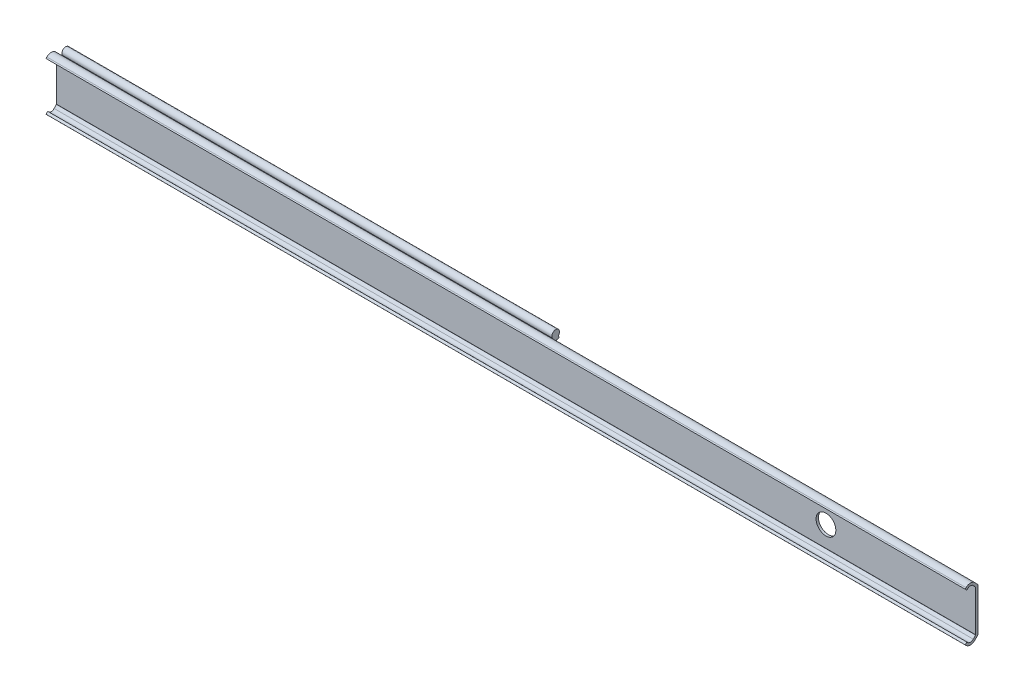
ISO-10303-21;
HEADER;
FILE_DESCRIPTION(('STEP AP214'),'2;1');
FILE_NAME('part.step','',(''),(''),'','','');
FILE_SCHEMA(('AUTOMOTIVE_DESIGN { 1 0 10303 214 1 1 1 1 }'));
ENDSEC;
DATA;
#1=APPLICATION_CONTEXT('core data for automotive mechanical design processes');
#2=APPLICATION_PROTOCOL_DEFINITION('international standard','automotive_design',2000,#1);
#3=PRODUCT_CONTEXT('',#1,'mechanical');
#4=PRODUCT('Part','Part','',(#3));
#5=PRODUCT_RELATED_PRODUCT_CATEGORY('part','',(#4));
#6=PRODUCT_DEFINITION_FORMATION('','',#4);
#7=PRODUCT_DEFINITION_CONTEXT('part definition',#1,'design');
#8=PRODUCT_DEFINITION('design','',#6,#7);
#9=PRODUCT_DEFINITION_SHAPE('','',#8);
#10=(LENGTH_UNIT() NAMED_UNIT(*) SI_UNIT(.MILLI.,.METRE.));
#11=(NAMED_UNIT(*) PLANE_ANGLE_UNIT() SI_UNIT($,.RADIAN.));
#12=(NAMED_UNIT(*) SI_UNIT($,.STERADIAN.) SOLID_ANGLE_UNIT());
#13=UNCERTAINTY_MEASURE_WITH_UNIT(LENGTH_MEASURE(1.E-05),#10,'distance_accuracy_value','');
#14=(GEOMETRIC_REPRESENTATION_CONTEXT(3) GLOBAL_UNCERTAINTY_ASSIGNED_CONTEXT((#13)) GLOBAL_UNIT_ASSIGNED_CONTEXT((#10,
#11,#12)) REPRESENTATION_CONTEXT('',''));
#15=CARTESIAN_POINT('',(0.,0.,0.));
#16=DIRECTION('',(0.,0.,1.));
#17=DIRECTION('',(1.,0.,0.));
#18=AXIS2_PLACEMENT_3D('',#15,#16,#17);
#19=CARTESIAN_POINT('',(-4.,-13.561018,0.));
#20=DIRECTION('',(0.,0.,-1.));
#21=DIRECTION('',(1.,0.,0.));
#22=AXIS2_PLACEMENT_3D('',#19,#20,#21);
#23=PLANE('',#22);
#24=CARTESIAN_POINT('',(506.987020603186,0.,0.));
#25=DIRECTION('',(0.,0.,1.));
#26=DIRECTION('',(1.,0.,0.));
#27=AXIS2_PLACEMENT_3D('',#24,#25,#26);
#28=CIRCLE('',#27,6.5);
#29=CARTESIAN_POINT('',(513.487020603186,0.,0.));
#30=VERTEX_POINT('',#29);
#31=EDGE_CURVE('E364',#30,#30,#28,.F.);
#32=ORIENTED_EDGE('',*,*,#31,.F.);
#33=EDGE_LOOP('',(#32));
#34=FACE_BOUND('',#33,.T.);
#35=DIRECTION('',(0.,-1.,0.));
#36=VECTOR('',#35,1.);
#37=CARTESIAN_POINT('',(0.,13.561018,0.));
#38=LINE('',#37,#36);
#39=CARTESIAN_POINT('',(0.,-10.7622239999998,0.));
#40=VERTEX_POINT('',#39);
#41=CARTESIAN_POINT('',(0.,-13.561018,0.));
#42=VERTEX_POINT('',#41);
#43=EDGE_CURVE('E325',#40,#42,#38,.T.);
#44=ORIENTED_EDGE('',*,*,#43,.F.);
#45=DIRECTION('',(1.,0.,0.));
#46=VECTOR('',#45,1.);
#47=CARTESIAN_POINT('',(0.,-10.7622239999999,0.));
#48=LINE('',#47,#46);
#49=CARTESIAN_POINT('',(322.8,-10.7622239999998,0.));
#50=VERTEX_POINT('',#49);
#51=EDGE_CURVE('E9',#40,#50,#48,.T.);
#52=ORIENTED_EDGE('',*,*,#51,.T.);
#53=DIRECTION('',(0.,-1.,0.));
#54=VECTOR('',#53,1.);
#55=CARTESIAN_POINT('',(322.8,10.7622239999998,0.));
#56=LINE('',#55,#54);
#57=CARTESIAN_POINT('',(322.8,10.7622239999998,0.));
#58=VERTEX_POINT('',#57);
#59=EDGE_CURVE('E300',#58,#50,#56,.T.);
#60=ORIENTED_EDGE('',*,*,#59,.F.);
#61=DIRECTION('',(1.,0.,0.));
#62=VECTOR('',#61,1.);
#63=CARTESIAN_POINT('',(0.,10.7622239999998,0.));
#64=LINE('',#63,#62);
#65=CARTESIAN_POINT('',(0.,10.7622239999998,0.));
#66=VERTEX_POINT('',#65);
#67=EDGE_CURVE('E23',#66,#58,#64,.T.);
#68=ORIENTED_EDGE('',*,*,#67,.F.);
#69=CARTESIAN_POINT('',(0.,13.561018,0.));
#70=VERTEX_POINT('',#69);
#71=EDGE_CURVE('E326',#70,#66,#38,.T.);
#72=ORIENTED_EDGE('',*,*,#71,.F.);
#73=DIRECTION('',(1.,0.,0.));
#74=VECTOR('',#73,1.);
#75=CARTESIAN_POINT('',(-4.,13.561018,0.));
#76=LINE('',#75,#74);
#77=CARTESIAN_POINT('',(605.6,13.561018,0.));
#78=VERTEX_POINT('',#77);
#79=EDGE_CURVE('E436',#70,#78,#76,.T.);
#80=ORIENTED_EDGE('',*,*,#79,.T.);
#81=DIRECTION('',(0.,1.,0.));
#82=VECTOR('',#81,1.);
#83=CARTESIAN_POINT('',(605.6,-13.561018,0.));
#84=LINE('',#83,#82);
#85=CARTESIAN_POINT('',(605.6,-13.561018,0.));
#86=VERTEX_POINT('',#85);
#87=EDGE_CURVE('E422',#86,#78,#84,.T.);
#88=ORIENTED_EDGE('',*,*,#87,.F.);
#89=DIRECTION('',(1.,0.,0.));
#90=VECTOR('',#89,1.);
#91=CARTESIAN_POINT('',(-4.,-13.561018,0.));
#92=LINE('',#91,#90);
#93=EDGE_CURVE('E438',#42,#86,#92,.T.);
#94=ORIENTED_EDGE('',*,*,#93,.F.);
#95=EDGE_LOOP('',(#44,#52,#60,#68,#72,#80,#88,#94));
#96=FACE_BOUND('',#95,.T.);
#97=ADVANCED_FACE('F14',(#34,#96),#23,.T.);
#98=CARTESIAN_POINT('',(0.,-10.7622239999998,-1.66000000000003));
#99=DIRECTION('',(1.,0.,0.));
#100=DIRECTION('',(0.,0.,1.));
#101=AXIS2_PLACEMENT_3D('',#98,#99,#100);
#102=CYLINDRICAL_SURFACE('',#101,1.66);
#103=DIRECTION('',(1.,0.,0.));
#104=VECTOR('',#103,1.);
#105=CARTESIAN_POINT('',(0.,-12.2669175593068,-2.36106867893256));
#106=LINE('',#105,#104);
#107=CARTESIAN_POINT('',(0.,-12.2669175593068,-2.36106867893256));
#108=VERTEX_POINT('',#107);
#109=CARTESIAN_POINT('',(322.8,-12.2669175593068,-2.36106867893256));
#110=VERTEX_POINT('',#109);
#111=EDGE_CURVE('E237',#108,#110,#106,.T.);
#112=ORIENTED_EDGE('',*,*,#111,.T.);
#113=CARTESIAN_POINT('',(322.8,-10.7622239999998,-1.66000000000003));
#114=DIRECTION('',(1.,0.,0.));
#115=DIRECTION('',(0.,0.,-1.));
#116=AXIS2_PLACEMENT_3D('',#113,#114,#115);
#117=CIRCLE('',#116,1.66);
#118=EDGE_CURVE('E302',#50,#110,#117,.T.);
#119=ORIENTED_EDGE('',*,*,#118,.F.);
#120=ORIENTED_EDGE('',*,*,#51,.F.);
#121=CARTESIAN_POINT('',(0.,-10.7622239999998,-1.66000000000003));
#122=DIRECTION('',(1.,0.,0.));
#123=DIRECTION('',(0.,0.,-1.));
#124=AXIS2_PLACEMENT_3D('',#121,#122,#123);
#125=CIRCLE('',#124,1.66);
#126=EDGE_CURVE('E249',#40,#108,#125,.T.);
#127=ORIENTED_EDGE('',*,*,#126,.T.);
#128=EDGE_LOOP('',(#112,#119,#120,#127));
#129=FACE_BOUND('',#128,.T.);
#130=ADVANCED_FACE('F255',(#129),#102,.T.);
#131=CARTESIAN_POINT('',(0.,10.7622239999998,-1.66000000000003));
#132=DIRECTION('',(1.,0.,0.));
#133=DIRECTION('',(0.,0.,1.));
#134=AXIS2_PLACEMENT_3D('',#131,#132,#133);
#135=CYLINDRICAL_SURFACE('',#134,1.66);
#136=CARTESIAN_POINT('',(322.8,10.7622239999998,-1.66000000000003));
#137=DIRECTION('',(1.,0.,0.));
#138=DIRECTION('',(0.,0.,-1.));
#139=AXIS2_PLACEMENT_3D('',#136,#137,#138);
#140=CIRCLE('',#139,1.66000000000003);
#141=CARTESIAN_POINT('',(322.8,12.2669175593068,-2.36106867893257));
#142=VERTEX_POINT('',#141);
#143=EDGE_CURVE('E294',#142,#58,#140,.T.);
#144=ORIENTED_EDGE('',*,*,#143,.F.);
#145=DIRECTION('',(1.,0.,0.));
#146=VECTOR('',#145,1.);
#147=CARTESIAN_POINT('',(0.,12.2669175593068,-2.36106867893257));
#148=LINE('',#147,#146);
#149=CARTESIAN_POINT('',(0.,12.2669175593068,-2.36106867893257));
#150=VERTEX_POINT('',#149);
#151=EDGE_CURVE('E292',#150,#142,#148,.T.);
#152=ORIENTED_EDGE('',*,*,#151,.F.);
#153=CARTESIAN_POINT('',(0.,10.7622239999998,-1.66000000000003));
#154=DIRECTION('',(1.,0.,0.));
#155=DIRECTION('',(0.,0.,-1.));
#156=AXIS2_PLACEMENT_3D('',#153,#154,#155);
#157=CIRCLE('',#156,1.66000000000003);
#158=EDGE_CURVE('E245',#150,#66,#157,.T.);
#159=ORIENTED_EDGE('',*,*,#158,.T.);
#160=ORIENTED_EDGE('',*,*,#67,.T.);
#161=EDGE_LOOP('',(#144,#152,#159,#160));
#162=FACE_BOUND('',#161,.T.);
#163=ADVANCED_FACE('F533',(#162),#135,.T.);
#164=CARTESIAN_POINT('',(0.,11.8784795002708,-5.98462837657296));
#165=DIRECTION('',(0.,0.60181512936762,-0.798635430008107));
#166=DIRECTION('',(0.,0.798635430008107,0.60181512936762));
#167=AXIS2_PLACEMENT_3D('',#164,#165,#166);
#168=PLANE('',#167);
#169=DIRECTION('',(1.,0.,0.));
#170=VECTOR('',#169,1.);
#171=CARTESIAN_POINT('',(0.,11.6159967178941,-6.18242339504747));
#172=LINE('',#171,#170);
#173=CARTESIAN_POINT('',(0.,11.6159967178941,-6.18242339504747));
#174=VERTEX_POINT('',#173);
#175=CARTESIAN_POINT('',(322.8,11.6159967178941,-6.18242339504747));
#176=VERTEX_POINT('',#175);
#177=EDGE_CURVE('E295',#174,#176,#172,.T.);
#178=ORIENTED_EDGE('',*,*,#177,.T.);
#179=DIRECTION('',(0.,0.798635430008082,0.601815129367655));
#180=VECTOR('',#179,1.);
#181=CARTESIAN_POINT('',(322.8,11.0618539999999,-6.60000000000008));
#182=LINE('',#181,#180);
#183=CARTESIAN_POINT('',(322.8,11.0618539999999,-6.60000000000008));
#184=VERTEX_POINT('',#183);
#185=EDGE_CURVE('E320',#184,#176,#182,.T.);
#186=ORIENTED_EDGE('',*,*,#185,.F.);
#187=DIRECTION('',(1.,0.,0.));
#188=VECTOR('',#187,1.);
#189=CARTESIAN_POINT('',(0.,11.0618539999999,-6.60000000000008));
#190=LINE('',#189,#188);
#191=CARTESIAN_POINT('',(0.,11.0618539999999,-6.60000000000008));
#192=VERTEX_POINT('',#191);
#193=EDGE_CURVE('E371',#192,#184,#190,.T.);
#194=ORIENTED_EDGE('',*,*,#193,.F.);
#195=DIRECTION('',(0.,0.798635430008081,0.601815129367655));
#196=VECTOR('',#195,1.);
#197=CARTESIAN_POINT('',(0.,11.0618539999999,-6.60000000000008));
#198=LINE('',#197,#196);
#199=EDGE_CURVE('E283',#192,#174,#198,.T.);
#200=ORIENTED_EDGE('',*,*,#199,.T.);
#201=EDGE_LOOP('',(#178,#186,#194,#200));
#202=FACE_BOUND('',#201,.T.);
#203=ADVANCED_FACE('F527',(#202),#168,.T.);
#204=CARTESIAN_POINT('',(0.,11.0618539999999,-6.60000000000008));
#205=DIRECTION('',(0.,0.,-1.));
#206=DIRECTION('',(1.,0.,0.));
#207=AXIS2_PLACEMENT_3D('',#204,#205,#206);
#208=PLANE('',#207);
#209=ORIENTED_EDGE('',*,*,#193,.T.);
#210=DIRECTION('',(0.,1.,-1.14893332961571E-13));
#211=VECTOR('',#210,1.);
#212=CARTESIAN_POINT('',(322.8,10.4239399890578,-6.6));
#213=LINE('',#212,#211);
#214=CARTESIAN_POINT('',(322.8,10.4239399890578,-6.6));
#215=VERTEX_POINT('',#214);
#216=EDGE_CURVE('E318',#215,#184,#213,.T.);
#217=ORIENTED_EDGE('',*,*,#216,.F.);
#218=DIRECTION('',(1.,0.,0.));
#219=VECTOR('',#218,1.);
#220=CARTESIAN_POINT('',(0.,10.4239399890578,-6.6));
#221=LINE('',#220,#219);
#222=CARTESIAN_POINT('',(0.,10.4239399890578,-6.6));
#223=VERTEX_POINT('',#222);
#224=EDGE_CURVE('E475',#223,#215,#221,.T.);
#225=ORIENTED_EDGE('',*,*,#224,.F.);
#226=DIRECTION('',(0.,1.,-1.07415068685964E-13));
#227=VECTOR('',#226,1.);
#228=CARTESIAN_POINT('',(0.,10.4239399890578,-6.6));
#229=LINE('',#228,#227);
#230=EDGE_CURVE('E280',#223,#192,#229,.T.);
#231=ORIENTED_EDGE('',*,*,#230,.T.);
#232=EDGE_LOOP('',(#209,#217,#225,#231));
#233=FACE_BOUND('',#232,.T.);
#234=ADVANCED_FACE('F522',(#233),#208,.T.);
#235=CARTESIAN_POINT('',(0.,13.915,-4.44999999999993));
#236=DIRECTION('',(1.,0.,0.));
#237=DIRECTION('',(0.,0.,1.));
#238=AXIS2_PLACEMENT_3D('',#235,#236,#237);
#239=CYLINDRICAL_SURFACE('',#238,4.1);
#240=ORIENTED_EDGE('',*,*,#224,.T.);
#241=CARTESIAN_POINT('',(322.8,13.915,-4.44999999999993));
#242=DIRECTION('',(1.,0.,0.));
#243=DIRECTION('',(0.,0.,-1.));
#244=AXIS2_PLACEMENT_3D('',#241,#242,#243);
#245=CIRCLE('',#244,4.1);
#246=CARTESIAN_POINT('',(322.8,10.844402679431,-1.73312089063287));
#247=VERTEX_POINT('',#246);
#248=EDGE_CURVE('E316',#247,#215,#245,.T.);
#249=ORIENTED_EDGE('',*,*,#248,.F.);
#250=DIRECTION('',(1.,0.,0.));
#251=VECTOR('',#250,1.);
#252=CARTESIAN_POINT('',(0.,10.8444026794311,-1.7331208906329));
#253=LINE('',#252,#251);
#254=CARTESIAN_POINT('',(0.,10.8444026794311,-1.73312089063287));
#255=VERTEX_POINT('',#254);
#256=EDGE_CURVE('E478',#255,#247,#253,.T.);
#257=ORIENTED_EDGE('',*,*,#256,.F.);
#258=CARTESIAN_POINT('',(0.,13.915,-4.44999999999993));
#259=DIRECTION('',(1.,0.,0.));
#260=DIRECTION('',(0.,0.,-1.));
#261=AXIS2_PLACEMENT_3D('',#258,#259,#260);
#262=CIRCLE('',#261,4.1);
#263=EDGE_CURVE('E277',#255,#223,#262,.T.);
#264=ORIENTED_EDGE('',*,*,#263,.T.);
#265=EDGE_LOOP('',(#240,#249,#257,#264));
#266=FACE_BOUND('',#265,.T.);
#267=ADVANCED_FACE('F520',(#266),#239,.T.);
#268=CARTESIAN_POINT('',(0.,10.7622239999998,-1.66000000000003));
#269=DIRECTION('',(1.,0.,0.));
#270=DIRECTION('',(0.,0.,1.));
#271=AXIS2_PLACEMENT_3D('',#268,#269,#270);
#272=CYLINDRICAL_SURFACE('',#271,0.110000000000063);
#273=ORIENTED_EDGE('',*,*,#256,.T.);
#274=CARTESIAN_POINT('',(322.8,10.7622239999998,-1.66000000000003));
#275=DIRECTION('',(-1.,0.,0.));
#276=DIRECTION('',(0.,0.,-1.));
#277=AXIS2_PLACEMENT_3D('',#274,#275,#276);
#278=CIRCLE('',#277,0.110000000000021);
#279=CARTESIAN_POINT('',(322.8,10.7622239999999,-1.55000000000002));
#280=VERTEX_POINT('',#279);
#281=EDGE_CURVE('E314',#280,#247,#278,.T.);
#282=ORIENTED_EDGE('',*,*,#281,.F.);
#283=DIRECTION('',(1.,0.,0.));
#284=VECTOR('',#283,1.);
#285=CARTESIAN_POINT('',(0.,10.7622239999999,-1.55000000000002));
#286=LINE('',#285,#284);
#287=CARTESIAN_POINT('',(0.,10.7622239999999,-1.55));
#288=VERTEX_POINT('',#287);
#289=EDGE_CURVE('E481',#288,#280,#286,.T.);
#290=ORIENTED_EDGE('',*,*,#289,.F.);
#291=CARTESIAN_POINT('',(0.,10.7622239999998,-1.66000000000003));
#292=DIRECTION('',(-1.,0.,0.));
#293=DIRECTION('',(0.,0.,-1.));
#294=AXIS2_PLACEMENT_3D('',#291,#292,#293);
#295=CIRCLE('',#294,0.110000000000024);
#296=EDGE_CURVE('E274',#288,#255,#295,.T.);
#297=ORIENTED_EDGE('',*,*,#296,.T.);
#298=EDGE_LOOP('',(#273,#282,#290,#297));
#299=FACE_BOUND('',#298,.T.);
#300=ADVANCED_FACE('F515',(#299),#272,.F.);
#301=CARTESIAN_POINT('',(0.,-10.7622239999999,-1.55000000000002));
#302=DIRECTION('',(0.,0.,-1.));
#303=DIRECTION('',(1.,0.,0.));
#304=AXIS2_PLACEMENT_3D('',#301,#302,#303);
#305=PLANE('',#304);
#306=ORIENTED_EDGE('',*,*,#289,.T.);
#307=DIRECTION('',(0.,1.,0.));
#308=VECTOR('',#307,1.);
#309=CARTESIAN_POINT('',(322.8,-10.7622239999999,-1.54999999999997));
#310=LINE('',#309,#308);
#311=CARTESIAN_POINT('',(322.8,-10.7622239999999,-1.54999999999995));
#312=VERTEX_POINT('',#311);
#313=EDGE_CURVE('E312',#312,#280,#310,.T.);
#314=ORIENTED_EDGE('',*,*,#313,.F.);
#315=DIRECTION('',(1.,0.,0.));
#316=VECTOR('',#315,1.);
#317=CARTESIAN_POINT('',(0.,-10.7622239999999,-1.55000000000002));
#318=LINE('',#317,#316);
#319=CARTESIAN_POINT('',(0.,-10.7622239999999,-1.54999999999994));
#320=VERTEX_POINT('',#319);
#321=EDGE_CURVE('E484',#320,#312,#318,.T.);
#322=ORIENTED_EDGE('',*,*,#321,.F.);
#323=DIRECTION('',(0.,1.,0.));
#324=VECTOR('',#323,1.);
#325=CARTESIAN_POINT('',(0.,-10.7622239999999,-1.54999999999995));
#326=LINE('',#325,#324);
#327=EDGE_CURVE('E271',#320,#288,#326,.T.);
#328=ORIENTED_EDGE('',*,*,#327,.T.);
#329=EDGE_LOOP('',(#306,#314,#322,#328));
#330=FACE_BOUND('',#329,.T.);
#331=ADVANCED_FACE('F510',(#330),#305,.T.);
#332=CARTESIAN_POINT('',(0.,-10.7622239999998,-1.66000000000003));
#333=DIRECTION('',(1.,0.,0.));
#334=DIRECTION('',(0.,0.,1.));
#335=AXIS2_PLACEMENT_3D('',#332,#333,#334);
#336=CYLINDRICAL_SURFACE('',#335,0.110000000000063);
#337=ORIENTED_EDGE('',*,*,#321,.T.);
#338=CARTESIAN_POINT('',(322.8,-10.7622239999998,-1.66000000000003));
#339=DIRECTION('',(-1.,0.,0.));
#340=DIRECTION('',(0.,0.,-1.));
#341=AXIS2_PLACEMENT_3D('',#338,#339,#340);
#342=CIRCLE('',#341,0.110000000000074);
#343=CARTESIAN_POINT('',(322.8,-10.8444026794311,-1.73312089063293));
#344=VERTEX_POINT('',#343);
#345=EDGE_CURVE('E310',#344,#312,#342,.T.);
#346=ORIENTED_EDGE('',*,*,#345,.F.);
#347=DIRECTION('',(1.,0.,0.));
#348=VECTOR('',#347,1.);
#349=CARTESIAN_POINT('',(0.,-10.8444026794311,-1.7331208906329));
#350=LINE('',#349,#348);
#351=CARTESIAN_POINT('',(0.,-10.8444026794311,-1.73312089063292));
#352=VERTEX_POINT('',#351);
#353=EDGE_CURVE('E487',#352,#344,#350,.T.);
#354=ORIENTED_EDGE('',*,*,#353,.F.);
#355=CARTESIAN_POINT('',(0.,-10.7622239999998,-1.66000000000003));
#356=DIRECTION('',(-1.,0.,0.));
#357=DIRECTION('',(0.,0.,-1.));
#358=AXIS2_PLACEMENT_3D('',#355,#356,#357);
#359=CIRCLE('',#358,0.110000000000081);
#360=EDGE_CURVE('E268',#352,#320,#359,.T.);
#361=ORIENTED_EDGE('',*,*,#360,.T.);
#362=EDGE_LOOP('',(#337,#346,#354,#361));
#363=FACE_BOUND('',#362,.T.);
#364=ADVANCED_FACE('F508',(#363),#336,.F.);
#365=CARTESIAN_POINT('',(0.,-13.915,-4.44999999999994));
#366=DIRECTION('',(1.,0.,0.));
#367=DIRECTION('',(0.,0.,1.));
#368=AXIS2_PLACEMENT_3D('',#365,#366,#367);
#369=CYLINDRICAL_SURFACE('',#368,4.1);
#370=ORIENTED_EDGE('',*,*,#353,.T.);
#371=CARTESIAN_POINT('',(322.8,-13.915,-4.44999999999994));
#372=DIRECTION('',(1.,0.,0.));
#373=DIRECTION('',(0.,0.,-1.));
#374=AXIS2_PLACEMENT_3D('',#371,#372,#373);
#375=CIRCLE('',#374,4.09999999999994);
#376=CARTESIAN_POINT('',(322.8,-10.4239399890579,-6.6));
#377=VERTEX_POINT('',#376);
#378=EDGE_CURVE('E308',#377,#344,#375,.T.);
#379=ORIENTED_EDGE('',*,*,#378,.F.);
#380=DIRECTION('',(1.,0.,0.));
#381=VECTOR('',#380,1.);
#382=CARTESIAN_POINT('',(0.,-10.4239399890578,-6.60000000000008));
#383=LINE('',#382,#381);
#384=CARTESIAN_POINT('',(0.,-10.4239399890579,-6.6));
#385=VERTEX_POINT('',#384);
#386=EDGE_CURVE('E489',#385,#377,#383,.T.);
#387=ORIENTED_EDGE('',*,*,#386,.F.);
#388=CARTESIAN_POINT('',(0.,-13.915,-4.44999999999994));
#389=DIRECTION('',(1.,0.,0.));
#390=DIRECTION('',(0.,0.,-1.));
#391=AXIS2_PLACEMENT_3D('',#388,#389,#390);
#392=CIRCLE('',#391,4.09999999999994);
#393=EDGE_CURVE('E265',#385,#352,#392,.T.);
#394=ORIENTED_EDGE('',*,*,#393,.T.);
#395=EDGE_LOOP('',(#370,#379,#387,#394));
#396=FACE_BOUND('',#395,.T.);
#397=ADVANCED_FACE('F501',(#396),#369,.T.);
#398=CARTESIAN_POINT('',(0.,-11.0618539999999,-6.60000000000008));
#399=DIRECTION('',(0.,0.,-1.));
#400=DIRECTION('',(1.,0.,0.));
#401=AXIS2_PLACEMENT_3D('',#398,#399,#400);
#402=PLANE('',#401);
#403=ORIENTED_EDGE('',*,*,#386,.T.);
#404=DIRECTION('',(0.,1.,0.));
#405=VECTOR('',#404,1.);
#406=CARTESIAN_POINT('',(322.8,-11.0618539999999,-6.60000000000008));
#407=LINE('',#406,#405);
#408=CARTESIAN_POINT('',(322.8,-11.0618539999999,-6.60000000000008));
#409=VERTEX_POINT('',#408);
#410=EDGE_CURVE('E306',#409,#377,#407,.T.);
#411=ORIENTED_EDGE('',*,*,#410,.F.);
#412=DIRECTION('',(1.,0.,0.));
#413=VECTOR('',#412,1.);
#414=CARTESIAN_POINT('',(0.,-11.0618539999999,-6.60000000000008));
#415=LINE('',#414,#413);
#416=CARTESIAN_POINT('',(0.,-11.0618539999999,-6.60000000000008));
#417=VERTEX_POINT('',#416);
#418=EDGE_CURVE('E18',#417,#409,#415,.T.);
#419=ORIENTED_EDGE('',*,*,#418,.F.);
#420=DIRECTION('',(0.,1.,0.));
#421=VECTOR('',#420,1.);
#422=CARTESIAN_POINT('',(0.,-11.0618539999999,-6.60000000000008));
#423=LINE('',#422,#421);
#424=EDGE_CURVE('E262',#417,#385,#423,.T.);
#425=ORIENTED_EDGE('',*,*,#424,.T.);
#426=EDGE_LOOP('',(#403,#411,#419,#425));
#427=FACE_BOUND('',#426,.T.);
#428=ADVANCED_FACE('F496',(#427),#402,.T.);
#429=CARTESIAN_POINT('',(0.,-11.8784795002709,-5.98462837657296));
#430=DIRECTION('',(0.,-0.60181512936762,-0.798635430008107));
#431=DIRECTION('',(0.,0.798635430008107,-0.60181512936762));
#432=AXIS2_PLACEMENT_3D('',#429,#430,#431);
#433=PLANE('',#432);
#434=DIRECTION('',(0.,0.79863543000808,-0.601815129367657));
#435=VECTOR('',#434,1.);
#436=CARTESIAN_POINT('',(322.8,-11.8784795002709,-5.98462837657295));
#437=LINE('',#436,#435);
#438=CARTESIAN_POINT('',(322.8,-11.6159967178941,-6.18242339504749));
#439=VERTEX_POINT('',#438);
#440=EDGE_CURVE('E304',#439,#409,#437,.T.);
#441=ORIENTED_EDGE('',*,*,#440,.F.);
#442=DIRECTION('',(1.,0.,0.));
#443=VECTOR('',#442,1.);
#444=CARTESIAN_POINT('',(0.,-11.6159967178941,-6.18242339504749));
#445=LINE('',#444,#443);
#446=CARTESIAN_POINT('',(0.,-11.6159967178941,-6.18242339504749));
#447=VERTEX_POINT('',#446);
#448=EDGE_CURVE('E244',#447,#439,#445,.T.);
#449=ORIENTED_EDGE('',*,*,#448,.F.);
#450=DIRECTION('',(0.,0.79863543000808,-0.601815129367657));
#451=VECTOR('',#450,1.);
#452=CARTESIAN_POINT('',(0.,-11.6159967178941,-6.18242339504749));
#453=LINE('',#452,#451);
#454=EDGE_CURVE('E253',#447,#417,#453,.T.);
#455=ORIENTED_EDGE('',*,*,#454,.T.);
#456=ORIENTED_EDGE('',*,*,#418,.T.);
#457=EDGE_LOOP('',(#441,#449,#455,#456));
#458=FACE_BOUND('',#457,.T.);
#459=ADVANCED_FACE('F16',(#458),#433,.T.);
#460=CARTESIAN_POINT('',(-4.,13.575,5.));
#461=DIRECTION('',(1.,0.,0.));
#462=DIRECTION('',(0.,0.,1.));
#463=AXIS2_PLACEMENT_3D('',#460,#461,#462);
#464=CYLINDRICAL_SURFACE('',#463,4.1);
#465=DIRECTION('',(1.,0.,0.));
#466=VECTOR('',#465,1.);
#467=CARTESIAN_POINT('',(-4.,16.4741282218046,2.10085261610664));
#468=LINE('',#467,#466);
#469=CARTESIAN_POINT('',(0.,16.4741282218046,2.10085261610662));
#470=VERTEX_POINT('',#469);
#471=CARTESIAN_POINT('',(605.6,16.4741282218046,2.10085261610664));
#472=VERTEX_POINT('',#471);
#473=EDGE_CURVE('E432',#470,#472,#468,.T.);
#474=ORIENTED_EDGE('',*,*,#473,.F.);
#475=CARTESIAN_POINT('',(0.,13.575,5.));
#476=DIRECTION('',(-1.,0.,0.));
#477=DIRECTION('',(0.,0.,1.));
#478=AXIS2_PLACEMENT_3D('',#475,#476,#477);
#479=CIRCLE('',#478,4.1);
#480=CARTESIAN_POINT('',(0.,16.4741282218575,7.89914738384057));
#481=VERTEX_POINT('',#480);
#482=EDGE_CURVE('E360',#481,#470,#479,.T.);
#483=ORIENTED_EDGE('',*,*,#482,.F.);
#484=DIRECTION('',(1.,0.,0.));
#485=VECTOR('',#484,1.);
#486=CARTESIAN_POINT('',(-4.,16.4741282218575,7.89914738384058));
#487=LINE('',#486,#485);
#488=CARTESIAN_POINT('',(605.6,16.4741282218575,7.89914738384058));
#489=VERTEX_POINT('',#488);
#490=EDGE_CURVE('E431',#481,#489,#487,.T.);
#491=ORIENTED_EDGE('',*,*,#490,.T.);
#492=CARTESIAN_POINT('',(605.6,13.575,5.));
#493=DIRECTION('',(1.,0.,0.));
#494=DIRECTION('',(0.,0.,-1.));
#495=AXIS2_PLACEMENT_3D('',#492,#493,#494);
#496=CIRCLE('',#495,4.1);
#497=EDGE_CURVE('E370',#472,#489,#496,.T.);
#498=ORIENTED_EDGE('',*,*,#497,.F.);
#499=EDGE_LOOP('',(#474,#483,#491,#498));
#500=FACE_BOUND('',#499,.T.);
#501=ADVANCED_FACE('F621',(#500),#464,.T.);
#502=CARTESIAN_POINT('',(-4.,14.8073560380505,0.501292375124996));
#503=DIRECTION('',(0.,0.692409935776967,-0.721504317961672));
#504=DIRECTION('',(0.,0.721504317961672,0.692409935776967));
#505=AXIS2_PLACEMENT_3D('',#502,#503,#504);
#506=PLANE('',#505);
#507=DIRECTION('',(1.,0.,0.));
#508=VECTOR('',#507,1.);
#509=CARTESIAN_POINT('',(-4.,14.8073560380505,0.501292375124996));
#510=LINE('',#509,#508);
#511=CARTESIAN_POINT('',(0.,14.8073560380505,0.501292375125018));
#512=VERTEX_POINT('',#511);
#513=CARTESIAN_POINT('',(605.6,14.8073560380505,0.501292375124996));
#514=VERTEX_POINT('',#513);
#515=EDGE_CURVE('E434',#512,#514,#510,.T.);
#516=ORIENTED_EDGE('',*,*,#515,.F.);
#517=DIRECTION('',(0.,-0.721504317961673,-0.692409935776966));
#518=VECTOR('',#517,1.);
#519=CARTESIAN_POINT('',(0.,16.4741282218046,2.10085261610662));
#520=LINE('',#519,#518);
#521=EDGE_CURVE('E362',#470,#512,#520,.T.);
#522=ORIENTED_EDGE('',*,*,#521,.F.);
#523=ORIENTED_EDGE('',*,*,#473,.T.);
#524=DIRECTION('',(0.,0.721504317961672,0.692409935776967));
#525=VECTOR('',#524,1.);
#526=CARTESIAN_POINT('',(605.6,14.8073560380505,0.501292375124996));
#527=LINE('',#526,#525);
#528=EDGE_CURVE('E428',#514,#472,#527,.T.);
#529=ORIENTED_EDGE('',*,*,#528,.F.);
#530=EDGE_LOOP('',(#516,#522,#523,#529));
#531=FACE_BOUND('',#530,.T.);
#532=ADVANCED_FACE('F626',(#531),#506,.T.);
#533=CARTESIAN_POINT('',(-4.,13.5610179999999,1.79999999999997));
#534=DIRECTION('',(1.,0.,0.));
#535=DIRECTION('',(0.,0.,1.));
#536=AXIS2_PLACEMENT_3D('',#533,#534,#535);
#537=CYLINDRICAL_SURFACE('',#536,1.8);
#538=ORIENTED_EDGE('',*,*,#79,.F.);
#539=CARTESIAN_POINT('',(0.,13.5610179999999,1.79999999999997));
#540=DIRECTION('',(-1.,0.,0.));
#541=DIRECTION('',(0.,0.,1.));
#542=AXIS2_PLACEMENT_3D('',#539,#540,#541);
#543=CIRCLE('',#542,1.80000000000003);
#544=EDGE_CURVE('E323',#512,#70,#543,.T.);
#545=ORIENTED_EDGE('',*,*,#544,.F.);
#546=ORIENTED_EDGE('',*,*,#515,.T.);
#547=CARTESIAN_POINT('',(605.6,13.5610179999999,1.79999999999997));
#548=DIRECTION('',(1.,0.,0.));
#549=DIRECTION('',(0.,0.,-1.));
#550=AXIS2_PLACEMENT_3D('',#547,#548,#549);
#551=CIRCLE('',#550,1.8);
#552=EDGE_CURVE('E425',#78,#514,#551,.T.);
#553=ORIENTED_EDGE('',*,*,#552,.F.);
#554=EDGE_LOOP('',(#538,#545,#546,#553));
#555=FACE_BOUND('',#554,.T.);
#556=ADVANCED_FACE('F629',(#555),#537,.T.);
#557=CARTESIAN_POINT('',(-4.,-13.561018,1.79999999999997));
#558=DIRECTION('',(1.,0.,0.));
#559=DIRECTION('',(0.,0.,1.));
#560=AXIS2_PLACEMENT_3D('',#557,#558,#559);
#561=CYLINDRICAL_SURFACE('',#560,1.8);
#562=DIRECTION('',(1.,0.,0.));
#563=VECTOR('',#562,1.);
#564=CARTESIAN_POINT('',(-4.,-14.8073560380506,0.501292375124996));
#565=LINE('',#564,#563);
#566=CARTESIAN_POINT('',(0.,-14.8073560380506,0.501292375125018));
#567=VERTEX_POINT('',#566);
#568=CARTESIAN_POINT('',(605.6,-14.8073560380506,0.501292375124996));
#569=VERTEX_POINT('',#568);
#570=EDGE_CURVE('E440',#567,#569,#565,.T.);
#571=ORIENTED_EDGE('',*,*,#570,.F.);
#572=CARTESIAN_POINT('',(0.,-13.561018,1.79999999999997));
#573=DIRECTION('',(-1.,0.,0.));
#574=DIRECTION('',(0.,0.,1.));
#575=AXIS2_PLACEMENT_3D('',#572,#573,#574);
#576=CIRCLE('',#575,1.8);
#577=EDGE_CURVE('E329',#42,#567,#576,.T.);
#578=ORIENTED_EDGE('',*,*,#577,.F.);
#579=ORIENTED_EDGE('',*,*,#93,.T.);
#580=CARTESIAN_POINT('',(605.6,-13.561018,1.79999999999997));
#581=DIRECTION('',(1.,0.,0.));
#582=DIRECTION('',(0.,0.,1.));
#583=AXIS2_PLACEMENT_3D('',#580,#581,#582);
#584=CIRCLE('',#583,1.8);
#585=EDGE_CURVE('E419',#569,#86,#584,.T.);
#586=ORIENTED_EDGE('',*,*,#585,.F.);
#587=EDGE_LOOP('',(#571,#578,#579,#586));
#588=FACE_BOUND('',#587,.T.);
#589=ADVANCED_FACE('F543',(#588),#561,.T.);
#590=CARTESIAN_POINT('',(-4.,-14.8073560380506,0.501292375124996));
#591=DIRECTION('',(0.,-0.692409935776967,-0.721504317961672));
#592=DIRECTION('',(0.,0.721504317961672,-0.692409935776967));
#593=AXIS2_PLACEMENT_3D('',#590,#591,#592);
#594=PLANE('',#593);
#595=DIRECTION('',(1.,0.,0.));
#596=VECTOR('',#595,1.);
#597=CARTESIAN_POINT('',(-4.,-16.4741282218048,2.10085261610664));
#598=LINE('',#597,#596);
#599=CARTESIAN_POINT('',(0.,-16.4741282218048,2.10085261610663));
#600=VERTEX_POINT('',#599);
#601=CARTESIAN_POINT('',(605.6,-16.4741282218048,2.10085261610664));
#602=VERTEX_POINT('',#601);
#603=EDGE_CURVE('E442',#600,#602,#598,.T.);
#604=ORIENTED_EDGE('',*,*,#603,.F.);
#605=DIRECTION('',(0.,-0.721504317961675,0.692409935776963));
#606=VECTOR('',#605,1.);
#607=CARTESIAN_POINT('',(0.,-14.8073560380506,0.501292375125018));
#608=LINE('',#607,#606);
#609=EDGE_CURVE('E331',#567,#600,#608,.T.);
#610=ORIENTED_EDGE('',*,*,#609,.F.);
#611=ORIENTED_EDGE('',*,*,#570,.T.);
#612=DIRECTION('',(0.,0.721504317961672,-0.692409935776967));
#613=VECTOR('',#612,1.);
#614=CARTESIAN_POINT('',(605.6,-14.8073560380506,0.501292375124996));
#615=LINE('',#614,#613);
#616=EDGE_CURVE('E416',#602,#569,#615,.T.);
#617=ORIENTED_EDGE('',*,*,#616,.F.);
#618=EDGE_LOOP('',(#604,#610,#611,#617));
#619=FACE_BOUND('',#618,.T.);
#620=ADVANCED_FACE('F548',(#619),#594,.T.);
#621=CARTESIAN_POINT('',(-4.,-13.5750000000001,5.));
#622=DIRECTION('',(1.,0.,0.));
#623=DIRECTION('',(0.,0.,1.));
#624=AXIS2_PLACEMENT_3D('',#621,#622,#623);
#625=CYLINDRICAL_SURFACE('',#624,4.1);
#626=DIRECTION('',(1.,0.,0.));
#627=VECTOR('',#626,1.);
#628=CARTESIAN_POINT('',(-4.,-16.4741282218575,7.89914738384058));
#629=LINE('',#628,#627);
#630=CARTESIAN_POINT('',(0.,-16.4741282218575,7.89914738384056));
#631=VERTEX_POINT('',#630);
#632=CARTESIAN_POINT('',(605.6,-16.4741282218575,7.89914738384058));
#633=VERTEX_POINT('',#632);
#634=EDGE_CURVE('E444',#631,#633,#629,.T.);
#635=ORIENTED_EDGE('',*,*,#634,.F.);
#636=CARTESIAN_POINT('',(0.,-13.5750000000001,5.));
#637=DIRECTION('',(-1.,0.,0.));
#638=DIRECTION('',(0.,0.,1.));
#639=AXIS2_PLACEMENT_3D('',#636,#637,#638);
#640=CIRCLE('',#639,4.09999999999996);
#641=EDGE_CURVE('E333',#600,#631,#640,.T.);
#642=ORIENTED_EDGE('',*,*,#641,.F.);
#643=ORIENTED_EDGE('',*,*,#603,.T.);
#644=CARTESIAN_POINT('',(605.6,-13.5750000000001,5.));
#645=DIRECTION('',(1.,0.,0.));
#646=DIRECTION('',(0.,0.,1.));
#647=AXIS2_PLACEMENT_3D('',#644,#645,#646);
#648=CIRCLE('',#647,4.1);
#649=EDGE_CURVE('E413',#633,#602,#648,.T.);
#650=ORIENTED_EDGE('',*,*,#649,.F.);
#651=EDGE_LOOP('',(#635,#642,#643,#650));
#652=FACE_BOUND('',#651,.T.);
#653=ADVANCED_FACE('F553',(#652),#625,.T.);
#654=CARTESIAN_POINT('',(-4.,-15.8897090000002,8.46));
#655=DIRECTION('',(0.,-0.692409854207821,0.721504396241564));
#656=DIRECTION('',(0.,-0.721504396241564,-0.692409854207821));
#657=AXIS2_PLACEMENT_3D('',#654,#655,#656);
#658=PLANE('',#657);
#659=DIRECTION('',(1.,0.,0.));
#660=VECTOR('',#659,1.);
#661=CARTESIAN_POINT('',(-4.,-15.8897090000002,8.46));
#662=LINE('',#661,#660);
#663=CARTESIAN_POINT('',(0.,-15.8897090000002,8.46));
#664=VERTEX_POINT('',#663);
#665=CARTESIAN_POINT('',(605.6,-15.8897090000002,8.46));
#666=VERTEX_POINT('',#665);
#667=EDGE_CURVE('E446',#664,#666,#662,.T.);
#668=ORIENTED_EDGE('',*,*,#667,.F.);
#669=DIRECTION('',(0.,0.721504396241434,0.692409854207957));
#670=VECTOR('',#669,1.);
#671=CARTESIAN_POINT('',(0.,-16.4741282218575,7.89914738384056));
#672=LINE('',#671,#670);
#673=EDGE_CURVE('E335',#631,#664,#672,.T.);
#674=ORIENTED_EDGE('',*,*,#673,.F.);
#675=ORIENTED_EDGE('',*,*,#634,.T.);
#676=DIRECTION('',(0.,-0.721504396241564,-0.692409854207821));
#677=VECTOR('',#676,1.);
#678=CARTESIAN_POINT('',(605.6,-15.8897090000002,8.46));
#679=LINE('',#678,#677);
#680=EDGE_CURVE('E410',#666,#633,#679,.T.);
#681=ORIENTED_EDGE('',*,*,#680,.F.);
#682=EDGE_LOOP('',(#668,#674,#675,#681));
#683=FACE_BOUND('',#682,.T.);
#684=ADVANCED_FACE('F558',(#683),#658,.T.);
#685=CARTESIAN_POINT('',(-4.,-14.7934620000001,7.36375199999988));
#686=DIRECTION('',(0.,0.707107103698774,0.707106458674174));
#687=DIRECTION('',(0.,-0.707106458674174,0.707107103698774));
#688=AXIS2_PLACEMENT_3D('',#685,#686,#687);
#689=PLANE('',#688);
#690=DIRECTION('',(1.,0.,0.));
#691=VECTOR('',#690,1.);
#692=CARTESIAN_POINT('',(-4.,-14.7934620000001,7.36375199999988));
#693=LINE('',#692,#691);
#694=CARTESIAN_POINT('',(0.,-14.7934620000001,7.36375199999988));
#695=VERTEX_POINT('',#694);
#696=CARTESIAN_POINT('',(605.6,-14.7934620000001,7.36375199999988));
#697=VERTEX_POINT('',#696);
#698=EDGE_CURVE('E448',#695,#697,#693,.T.);
#699=ORIENTED_EDGE('',*,*,#698,.F.);
#700=DIRECTION('',(0.,0.707106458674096,-0.707107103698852));
#701=VECTOR('',#700,1.);
#702=CARTESIAN_POINT('',(0.,-15.8897090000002,8.46));
#703=LINE('',#702,#701);
#704=EDGE_CURVE('E337',#664,#695,#703,.T.);
#705=ORIENTED_EDGE('',*,*,#704,.F.);
#706=ORIENTED_EDGE('',*,*,#667,.T.);
#707=DIRECTION('',(0.,-0.707106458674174,0.707107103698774));
#708=VECTOR('',#707,1.);
#709=CARTESIAN_POINT('',(605.6,-14.7934620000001,7.36375199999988));
#710=LINE('',#709,#708);
#711=EDGE_CURVE('E407',#697,#666,#710,.T.);
#712=ORIENTED_EDGE('',*,*,#711,.F.);
#713=EDGE_LOOP('',(#699,#705,#706,#712));
#714=FACE_BOUND('',#713,.T.);
#715=ADVANCED_FACE('F563',(#714),#689,.T.);
#716=CARTESIAN_POINT('',(-4.,-15.3880487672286,6.79314086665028));
#717=DIRECTION('',(0.,0.692410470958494,-0.721503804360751));
#718=DIRECTION('',(0.,0.721503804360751,0.692410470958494));
#719=AXIS2_PLACEMENT_3D('',#716,#717,#718);
#720=PLANE('',#719);
#721=DIRECTION('',(1.,0.,0.));
#722=VECTOR('',#721,1.);
#723=CARTESIAN_POINT('',(-4.,-15.3880487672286,6.79314086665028));
#724=LINE('',#723,#722);
#725=CARTESIAN_POINT('',(0.,-15.3880487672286,6.79314086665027));
#726=VERTEX_POINT('',#725);
#727=CARTESIAN_POINT('',(605.6,-15.3880487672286,6.79314086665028));
#728=VERTEX_POINT('',#727);
#729=EDGE_CURVE('E450',#726,#728,#724,.T.);
#730=ORIENTED_EDGE('',*,*,#729,.F.);
#731=DIRECTION('',(0.,-0.721503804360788,-0.692410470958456));
#732=VECTOR('',#731,1.);
#733=CARTESIAN_POINT('',(0.,-14.7934620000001,7.36375199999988));
#734=LINE('',#733,#732);
#735=EDGE_CURVE('E339',#695,#726,#734,.T.);
#736=ORIENTED_EDGE('',*,*,#735,.F.);
#737=ORIENTED_EDGE('',*,*,#698,.T.);
#738=DIRECTION('',(0.,0.721503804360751,0.692410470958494));
#739=VECTOR('',#738,1.);
#740=CARTESIAN_POINT('',(605.6,-15.3880487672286,6.79314086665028));
#741=LINE('',#740,#739);
#742=EDGE_CURVE('E404',#728,#697,#741,.T.);
#743=ORIENTED_EDGE('',*,*,#742,.F.);
#744=EDGE_LOOP('',(#730,#736,#737,#743));
#745=FACE_BOUND('',#744,.T.);
#746=ADVANCED_FACE('F568',(#745),#720,.T.);
#747=CARTESIAN_POINT('',(-4.,-13.5750000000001,5.));
#748=DIRECTION('',(1.,0.,0.));
#749=DIRECTION('',(0.,0.,1.));
#750=AXIS2_PLACEMENT_3D('',#747,#748,#749);
#751=CYLINDRICAL_SURFACE('',#750,2.55);
#752=DIRECTION('',(1.,0.,0.));
#753=VECTOR('',#752,1.);
#754=CARTESIAN_POINT('',(-4.,-15.292068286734,3.11474762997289));
#755=LINE('',#754,#753);
#756=CARTESIAN_POINT('',(0.,-15.292068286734,3.11474762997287));
#757=VERTEX_POINT('',#756);
#758=CARTESIAN_POINT('',(605.6,-15.292068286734,3.11474762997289));
#759=VERTEX_POINT('',#758);
#760=EDGE_CURVE('E452',#757,#759,#755,.T.);
#761=ORIENTED_EDGE('',*,*,#760,.F.);
#762=CARTESIAN_POINT('',(0.,-13.5750000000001,5.));
#763=DIRECTION('',(1.,0.,0.));
#764=DIRECTION('',(0.,0.,1.));
#765=AXIS2_PLACEMENT_3D('',#762,#763,#764);
#766=CIRCLE('',#765,2.55);
#767=EDGE_CURVE('E341',#726,#757,#766,.T.);
#768=ORIENTED_EDGE('',*,*,#767,.F.);
#769=ORIENTED_EDGE('',*,*,#729,.T.);
#770=CARTESIAN_POINT('',(605.6,-13.5750000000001,5.));
#771=DIRECTION('',(-1.,0.,0.));
#772=DIRECTION('',(0.,0.,-1.));
#773=AXIS2_PLACEMENT_3D('',#770,#771,#772);
#774=CIRCLE('',#773,2.55);
#775=EDGE_CURVE('E401',#759,#728,#774,.T.);
#776=ORIENTED_EDGE('',*,*,#775,.F.);
#777=EDGE_LOOP('',(#761,#768,#769,#776));
#778=FACE_BOUND('',#777,.T.);
#779=ADVANCED_FACE('F573',(#778),#751,.F.);
#780=CARTESIAN_POINT('',(-4.,-13.7341205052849,1.6196239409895));
#781=DIRECTION('',(0.,0.692409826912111,0.721504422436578));
#782=DIRECTION('',(0.,-0.721504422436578,0.692409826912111));
#783=AXIS2_PLACEMENT_3D('',#780,#781,#782);
#784=PLANE('',#783);
#785=DIRECTION('',(1.,0.,0.));
#786=VECTOR('',#785,1.);
#787=CARTESIAN_POINT('',(-4.,-13.734120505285,1.61962394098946));
#788=LINE('',#787,#786);
#789=CARTESIAN_POINT('',(0.,-13.734120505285,1.61962394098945));
#790=VERTEX_POINT('',#789);
#791=CARTESIAN_POINT('',(605.6,-13.734120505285,1.61962394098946));
#792=VERTEX_POINT('',#791);
#793=EDGE_CURVE('E454',#790,#792,#788,.T.);
#794=ORIENTED_EDGE('',*,*,#793,.F.);
#795=DIRECTION('',(0.,0.721504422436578,-0.692409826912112));
#796=VECTOR('',#795,1.);
#797=CARTESIAN_POINT('',(0.,-15.292068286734,3.11474762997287));
#798=LINE('',#797,#796);
#799=EDGE_CURVE('E343',#757,#790,#798,.T.);
#800=ORIENTED_EDGE('',*,*,#799,.F.);
#801=ORIENTED_EDGE('',*,*,#760,.T.);
#802=DIRECTION('',(0.,-0.721504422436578,0.692409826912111));
#803=VECTOR('',#802,1.);
#804=CARTESIAN_POINT('',(605.6,-13.7341205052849,1.6196239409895));
#805=LINE('',#804,#803);
#806=EDGE_CURVE('E398',#792,#759,#805,.T.);
#807=ORIENTED_EDGE('',*,*,#806,.F.);
#808=EDGE_LOOP('',(#794,#800,#801,#807));
#809=FACE_BOUND('',#808,.T.);
#810=ADVANCED_FACE('F578',(#809),#784,.T.);
#811=CARTESIAN_POINT('',(-4.,-13.561018,1.79999999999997));
#812=DIRECTION('',(1.,0.,0.));
#813=DIRECTION('',(0.,0.,1.));
#814=AXIS2_PLACEMENT_3D('',#811,#812,#813);
#815=CYLINDRICAL_SURFACE('',#814,0.250000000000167);
#816=DIRECTION('',(1.,0.,0.));
#817=VECTOR('',#816,1.);
#818=CARTESIAN_POINT('',(-4.,-13.561018,1.54999999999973));
#819=LINE('',#818,#817);
#820=CARTESIAN_POINT('',(0.,-13.561018,1.54999999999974));
#821=VERTEX_POINT('',#820);
#822=CARTESIAN_POINT('',(605.6,-13.561018,1.54999999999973));
#823=VERTEX_POINT('',#822);
#824=EDGE_CURVE('E456',#821,#823,#819,.T.);
#825=ORIENTED_EDGE('',*,*,#824,.F.);
#826=CARTESIAN_POINT('',(0.,-13.561018,1.79999999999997));
#827=DIRECTION('',(1.,0.,0.));
#828=DIRECTION('',(0.,0.,1.));
#829=AXIS2_PLACEMENT_3D('',#826,#827,#828);
#830=CIRCLE('',#829,0.250000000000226);
#831=EDGE_CURVE('E345',#790,#821,#830,.T.);
#832=ORIENTED_EDGE('',*,*,#831,.F.);
#833=ORIENTED_EDGE('',*,*,#793,.T.);
#834=CARTESIAN_POINT('',(605.6,-13.561018,1.79999999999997));
#835=DIRECTION('',(-1.,0.,0.));
#836=DIRECTION('',(0.,0.,-1.));
#837=AXIS2_PLACEMENT_3D('',#834,#835,#836);
#838=CIRCLE('',#837,0.250000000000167);
#839=EDGE_CURVE('E395',#823,#792,#838,.T.);
#840=ORIENTED_EDGE('',*,*,#839,.F.);
#841=EDGE_LOOP('',(#825,#832,#833,#840));
#842=FACE_BOUND('',#841,.T.);
#843=ADVANCED_FACE('F583',(#842),#815,.F.);
#844=CARTESIAN_POINT('',(-4.,13.561018,1.54999999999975));
#845=DIRECTION('',(0.,0.,1.));
#846=DIRECTION('',(-1.,0.,0.));
#847=AXIS2_PLACEMENT_3D('',#844,#845,#846);
#848=PLANE('',#847);
#849=CARTESIAN_POINT('',(506.987020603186,0.,1.54999999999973));
#850=DIRECTION('',(0.,0.,1.));
#851=DIRECTION('',(-1.,0.,0.));
#852=AXIS2_PLACEMENT_3D('',#849,#850,#851);
#853=CIRCLE('',#852,6.5);
#854=CARTESIAN_POINT('',(500.487020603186,0.,1.54999999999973));
#855=VERTEX_POINT('',#854);
#856=EDGE_CURVE('E367',#855,#855,#853,.T.);
#857=ORIENTED_EDGE('',*,*,#856,.F.);
#858=EDGE_LOOP('',(#857));
#859=FACE_BOUND('',#858,.T.);
#860=DIRECTION('',(1.,0.,0.));
#861=VECTOR('',#860,1.);
#862=CARTESIAN_POINT('',(-4.,13.561018,1.54999999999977));
#863=LINE('',#862,#861);
#864=CARTESIAN_POINT('',(0.,13.561018,1.54999999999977));
#865=VERTEX_POINT('',#864);
#866=CARTESIAN_POINT('',(605.6,13.561018,1.54999999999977));
#867=VERTEX_POINT('',#866);
#868=EDGE_CURVE('E458',#865,#867,#863,.T.);
#869=ORIENTED_EDGE('',*,*,#868,.F.);
#870=DIRECTION('',(0.,1.,0.));
#871=VECTOR('',#870,1.);
#872=CARTESIAN_POINT('',(0.,-13.561018,1.54999999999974));
#873=LINE('',#872,#871);
#874=EDGE_CURVE('E347',#821,#865,#873,.T.);
#875=ORIENTED_EDGE('',*,*,#874,.F.);
#876=ORIENTED_EDGE('',*,*,#824,.T.);
#877=DIRECTION('',(0.,-1.,0.));
#878=VECTOR('',#877,1.);
#879=CARTESIAN_POINT('',(605.6,13.561018,1.54999999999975));
#880=LINE('',#879,#878);
#881=EDGE_CURVE('E392',#867,#823,#880,.T.);
#882=ORIENTED_EDGE('',*,*,#881,.F.);
#883=EDGE_LOOP('',(#869,#875,#876,#882));
#884=FACE_BOUND('',#883,.T.);
#885=ADVANCED_FACE('F588',(#859,#884),#848,.T.);
#886=CARTESIAN_POINT('',(-4.,13.5610179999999,1.79999999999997));
#887=DIRECTION('',(1.,0.,0.));
#888=DIRECTION('',(0.,0.,1.));
#889=AXIS2_PLACEMENT_3D('',#886,#887,#888);
#890=CYLINDRICAL_SURFACE('',#889,0.250000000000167);
#891=DIRECTION('',(1.,0.,0.));
#892=VECTOR('',#891,1.);
#893=CARTESIAN_POINT('',(-4.,13.734120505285,1.6196239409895));
#894=LINE('',#893,#892);
#895=CARTESIAN_POINT('',(0.,13.734120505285,1.6196239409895));
#896=VERTEX_POINT('',#895);
#897=CARTESIAN_POINT('',(605.6,13.734120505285,1.6196239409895));
#898=VERTEX_POINT('',#897);
#899=EDGE_CURVE('E460',#896,#898,#894,.T.);
#900=ORIENTED_EDGE('',*,*,#899,.F.);
#901=CARTESIAN_POINT('',(0.,13.5610179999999,1.79999999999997));
#902=DIRECTION('',(1.,0.,0.));
#903=DIRECTION('',(0.,0.,1.));
#904=AXIS2_PLACEMENT_3D('',#901,#902,#903);
#905=CIRCLE('',#904,0.250000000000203);
#906=EDGE_CURVE('E349',#865,#896,#905,.T.);
#907=ORIENTED_EDGE('',*,*,#906,.F.);
#908=ORIENTED_EDGE('',*,*,#868,.T.);
#909=CARTESIAN_POINT('',(605.6,13.5610179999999,1.79999999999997));
#910=DIRECTION('',(-1.,0.,0.));
#911=DIRECTION('',(0.,0.,1.));
#912=AXIS2_PLACEMENT_3D('',#909,#910,#911);
#913=CIRCLE('',#912,0.250000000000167);
#914=EDGE_CURVE('E389',#898,#867,#913,.T.);
#915=ORIENTED_EDGE('',*,*,#914,.F.);
#916=EDGE_LOOP('',(#900,#907,#908,#915));
#917=FACE_BOUND('',#916,.T.);
#918=ADVANCED_FACE('F593',(#917),#890,.F.);
#919=CARTESIAN_POINT('',(-4.,13.734120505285,1.6196239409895));
#920=DIRECTION('',(0.,-0.692409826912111,0.721504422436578));
#921=DIRECTION('',(0.,-0.721504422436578,-0.692409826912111));
#922=AXIS2_PLACEMENT_3D('',#919,#920,#921);
#923=PLANE('',#922);
#924=DIRECTION('',(1.,0.,0.));
#925=VECTOR('',#924,1.);
#926=CARTESIAN_POINT('',(-4.,15.2920682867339,3.11474762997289));
#927=LINE('',#926,#925);
#928=CARTESIAN_POINT('',(0.,15.2920682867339,3.11474762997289));
#929=VERTEX_POINT('',#928);
#930=CARTESIAN_POINT('',(605.6,15.2920682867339,3.11474762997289));
#931=VERTEX_POINT('',#930);
#932=EDGE_CURVE('E462',#929,#931,#927,.T.);
#933=ORIENTED_EDGE('',*,*,#932,.F.);
#934=DIRECTION('',(0.,0.721504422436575,0.692409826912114));
#935=VECTOR('',#934,1.);
#936=CARTESIAN_POINT('',(0.,13.734120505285,1.6196239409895));
#937=LINE('',#936,#935);
#938=EDGE_CURVE('E351',#896,#929,#937,.T.);
#939=ORIENTED_EDGE('',*,*,#938,.F.);
#940=ORIENTED_EDGE('',*,*,#899,.T.);
#941=DIRECTION('',(0.,-0.721504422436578,-0.692409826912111));
#942=VECTOR('',#941,1.);
#943=CARTESIAN_POINT('',(605.6,13.734120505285,1.6196239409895));
#944=LINE('',#943,#942);
#945=EDGE_CURVE('E386',#931,#898,#944,.T.);
#946=ORIENTED_EDGE('',*,*,#945,.F.);
#947=EDGE_LOOP('',(#933,#939,#940,#946));
#948=FACE_BOUND('',#947,.T.);
#949=ADVANCED_FACE('F598',(#948),#923,.T.);
#950=CARTESIAN_POINT('',(-4.,13.575,5.));
#951=DIRECTION('',(1.,0.,0.));
#952=DIRECTION('',(0.,0.,1.));
#953=AXIS2_PLACEMENT_3D('',#950,#951,#952);
#954=CYLINDRICAL_SURFACE('',#953,2.55);
#955=DIRECTION('',(1.,0.,0.));
#956=VECTOR('',#955,1.);
#957=CARTESIAN_POINT('',(-4.,15.3880487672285,6.79314086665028));
#958=LINE('',#957,#956);
#959=CARTESIAN_POINT('',(0.,15.3880487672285,6.79314086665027));
#960=VERTEX_POINT('',#959);
#961=CARTESIAN_POINT('',(605.6,15.3880487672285,6.79314086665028));
#962=VERTEX_POINT('',#961);
#963=EDGE_CURVE('E464',#960,#962,#958,.T.);
#964=ORIENTED_EDGE('',*,*,#963,.F.);
#965=CARTESIAN_POINT('',(0.,13.575,5.));
#966=DIRECTION('',(1.,0.,0.));
#967=DIRECTION('',(0.,0.,1.));
#968=AXIS2_PLACEMENT_3D('',#965,#966,#967);
#969=CIRCLE('',#968,2.55000000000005);
#970=EDGE_CURVE('E353',#929,#960,#969,.T.);
#971=ORIENTED_EDGE('',*,*,#970,.F.);
#972=ORIENTED_EDGE('',*,*,#932,.T.);
#973=CARTESIAN_POINT('',(605.6,13.575,5.));
#974=DIRECTION('',(-1.,0.,0.));
#975=DIRECTION('',(0.,0.,1.));
#976=AXIS2_PLACEMENT_3D('',#973,#974,#975);
#977=CIRCLE('',#976,2.55);
#978=EDGE_CURVE('E383',#962,#931,#977,.T.);
#979=ORIENTED_EDGE('',*,*,#978,.F.);
#980=EDGE_LOOP('',(#964,#971,#972,#979));
#981=FACE_BOUND('',#980,.T.);
#982=ADVANCED_FACE('F603',(#981),#954,.F.);
#983=CARTESIAN_POINT('',(-4.,15.3880487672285,6.79314086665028));
#984=DIRECTION('',(0.,-0.692410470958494,-0.721503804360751));
#985=DIRECTION('',(0.,0.721503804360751,-0.692410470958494));
#986=AXIS2_PLACEMENT_3D('',#983,#984,#985);
#987=PLANE('',#986);
#988=DIRECTION('',(1.,0.,0.));
#989=VECTOR('',#988,1.);
#990=CARTESIAN_POINT('',(-4.,14.793462,7.363752));
#991=LINE('',#990,#989);
#992=CARTESIAN_POINT('',(0.,14.793462,7.363752));
#993=VERTEX_POINT('',#992);
#994=CARTESIAN_POINT('',(605.6,14.793462,7.363752));
#995=VERTEX_POINT('',#994);
#996=EDGE_CURVE('E466',#993,#995,#991,.T.);
#997=ORIENTED_EDGE('',*,*,#996,.F.);
#998=DIRECTION('',(0.,-0.721503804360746,0.692410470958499));
#999=VECTOR('',#998,1.);
#1000=CARTESIAN_POINT('',(0.,15.3880487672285,6.79314086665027));
#1001=LINE('',#1000,#999);
#1002=EDGE_CURVE('E355',#960,#993,#1001,.T.);
#1003=ORIENTED_EDGE('',*,*,#1002,.F.);
#1004=ORIENTED_EDGE('',*,*,#963,.T.);
#1005=DIRECTION('',(0.,0.721503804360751,-0.692410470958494));
#1006=VECTOR('',#1005,1.);
#1007=CARTESIAN_POINT('',(605.6,15.3880487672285,6.79314086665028));
#1008=LINE('',#1007,#1006);
#1009=EDGE_CURVE('E380',#995,#962,#1008,.T.);
#1010=ORIENTED_EDGE('',*,*,#1009,.F.);
#1011=EDGE_LOOP('',(#997,#1003,#1004,#1010));
#1012=FACE_BOUND('',#1011,.T.);
#1013=ADVANCED_FACE('F608',(#1012),#987,.T.);
#1014=CARTESIAN_POINT('',(-4.,14.793462,7.363752));
#1015=DIRECTION('',(0.,-0.707107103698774,0.707106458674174));
#1016=DIRECTION('',(0.,-0.707106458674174,-0.707107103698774));
#1017=AXIS2_PLACEMENT_3D('',#1014,#1015,#1016);
#1018=PLANE('',#1017);
#1019=DIRECTION('',(1.,0.,0.));
#1020=VECTOR('',#1019,1.);
#1021=CARTESIAN_POINT('',(-4.,15.8897090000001,8.46));
#1022=LINE('',#1021,#1020);
#1023=CARTESIAN_POINT('',(0.,15.8897090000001,8.46));
#1024=VERTEX_POINT('',#1023);
#1025=CARTESIAN_POINT('',(605.6,15.8897090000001,8.46));
#1026=VERTEX_POINT('',#1025);
#1027=EDGE_CURVE('E468',#1024,#1026,#1022,.T.);
#1028=ORIENTED_EDGE('',*,*,#1027,.F.);
#1029=DIRECTION('',(0.,0.707106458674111,0.707107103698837));
#1030=VECTOR('',#1029,1.);
#1031=CARTESIAN_POINT('',(0.,14.793462,7.363752));
#1032=LINE('',#1031,#1030);
#1033=EDGE_CURVE('E37',#993,#1024,#1032,.T.);
#1034=ORIENTED_EDGE('',*,*,#1033,.F.);
#1035=ORIENTED_EDGE('',*,*,#996,.T.);
#1036=DIRECTION('',(0.,-0.707106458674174,-0.707107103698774));
#1037=VECTOR('',#1036,1.);
#1038=CARTESIAN_POINT('',(605.6,14.793462,7.363752));
#1039=LINE('',#1038,#1037);
#1040=EDGE_CURVE('E377',#1026,#995,#1039,.T.);
#1041=ORIENTED_EDGE('',*,*,#1040,.F.);
#1042=EDGE_LOOP('',(#1028,#1034,#1035,#1041));
#1043=FACE_BOUND('',#1042,.T.);
#1044=ADVANCED_FACE('F611',(#1043),#1018,.T.);
#1045=CARTESIAN_POINT('',(-4.,15.8897090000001,8.46));
#1046=DIRECTION('',(0.,0.692409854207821,0.721504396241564));
#1047=DIRECTION('',(0.,-0.721504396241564,0.692409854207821));
#1048=AXIS2_PLACEMENT_3D('',#1045,#1046,#1047);
#1049=PLANE('',#1048);
#1050=ORIENTED_EDGE('',*,*,#490,.F.);
#1051=DIRECTION('',(0.,0.721504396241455,-0.692409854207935));
#1052=VECTOR('',#1051,1.);
#1053=CARTESIAN_POINT('',(0.,15.8897090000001,8.46));
#1054=LINE('',#1053,#1052);
#1055=EDGE_CURVE('E358',#1024,#481,#1054,.T.);
#1056=ORIENTED_EDGE('',*,*,#1055,.F.);
#1057=ORIENTED_EDGE('',*,*,#1027,.T.);
#1058=DIRECTION('',(0.,-0.721504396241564,0.692409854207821));
#1059=VECTOR('',#1058,1.);
#1060=CARTESIAN_POINT('',(605.6,15.8897090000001,8.46));
#1061=LINE('',#1060,#1059);
#1062=EDGE_CURVE('E374',#489,#1026,#1061,.T.);
#1063=ORIENTED_EDGE('',*,*,#1062,.F.);
#1064=EDGE_LOOP('',(#1050,#1056,#1057,#1063));
#1065=FACE_BOUND('',#1064,.T.);
#1066=ADVANCED_FACE('F616',(#1065),#1049,.T.);
#1067=CARTESIAN_POINT('',(605.6,13.575,5.));
#1068=DIRECTION('',(-1.,0.,0.));
#1069=DIRECTION('',(0.,0.,-1.));
#1070=AXIS2_PLACEMENT_3D('',#1067,#1068,#1069);
#1071=PLANE('',#1070);
#1072=ORIENTED_EDGE('',*,*,#87,.T.);
#1073=ORIENTED_EDGE('',*,*,#552,.T.);
#1074=ORIENTED_EDGE('',*,*,#528,.T.);
#1075=ORIENTED_EDGE('',*,*,#497,.T.);
#1076=ORIENTED_EDGE('',*,*,#1062,.T.);
#1077=ORIENTED_EDGE('',*,*,#1040,.T.);
#1078=ORIENTED_EDGE('',*,*,#1009,.T.);
#1079=ORIENTED_EDGE('',*,*,#978,.T.);
#1080=ORIENTED_EDGE('',*,*,#945,.T.);
#1081=ORIENTED_EDGE('',*,*,#914,.T.);
#1082=ORIENTED_EDGE('',*,*,#881,.T.);
#1083=ORIENTED_EDGE('',*,*,#839,.T.);
#1084=ORIENTED_EDGE('',*,*,#806,.T.);
#1085=ORIENTED_EDGE('',*,*,#775,.T.);
#1086=ORIENTED_EDGE('',*,*,#742,.T.);
#1087=ORIENTED_EDGE('',*,*,#711,.T.);
#1088=ORIENTED_EDGE('',*,*,#680,.T.);
#1089=ORIENTED_EDGE('',*,*,#649,.T.);
#1090=ORIENTED_EDGE('',*,*,#616,.T.);
#1091=ORIENTED_EDGE('',*,*,#585,.T.);
#1092=EDGE_LOOP('',(#1072,#1073,#1074,#1075,#1076,#1077,#1078,#1079,#1080,#1081,#1082,#1083,
#1084,#1085,#1086,#1087,#1088,#1089,#1090,#1091));
#1093=FACE_BOUND('',#1092,.T.);
#1094=ADVANCED_FACE('F632',(#1093),#1071,.F.);
#1095=CARTESIAN_POINT('',(506.987020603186,0.,-0.00100000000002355));
#1096=DIRECTION('',(0.,0.,1.));
#1097=DIRECTION('',(-1.,0.,0.));
#1098=AXIS2_PLACEMENT_3D('',#1095,#1096,#1097);
#1099=CYLINDRICAL_SURFACE('',#1098,6.5);
#1100=ORIENTED_EDGE('',*,*,#31,.T.);
#1101=EDGE_LOOP('',(#1100));
#1102=FACE_BOUND('',#1101,.T.);
#1103=ORIENTED_EDGE('',*,*,#856,.T.);
#1104=EDGE_LOOP('',(#1103));
#1105=FACE_BOUND('',#1104,.T.);
#1106=ADVANCED_FACE('F634',(#1102,#1105),#1099,.F.);
#1107=CARTESIAN_POINT('',(0.,13.5610179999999,1.79999999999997));
#1108=DIRECTION('',(-1.,0.,0.));
#1109=DIRECTION('',(0.,0.,1.));
#1110=AXIS2_PLACEMENT_3D('',#1107,#1108,#1109);
#1111=PLANE('',#1110);
#1112=ORIENTED_EDGE('',*,*,#544,.T.);
#1113=ORIENTED_EDGE('',*,*,#71,.T.);
#1114=ORIENTED_EDGE('',*,*,#158,.F.);
#1115=CARTESIAN_POINT('',(0.,13.575,-4.55));
#1116=DIRECTION('',(1.,0.,0.));
#1117=DIRECTION('',(0.,0.,-1.));
#1118=AXIS2_PLACEMENT_3D('',#1115,#1116,#1117);
#1119=CIRCLE('',#1118,2.55);
#1120=EDGE_CURVE('E286',#174,#150,#1119,.T.);
#1121=ORIENTED_EDGE('',*,*,#1120,.F.);
#1122=ORIENTED_EDGE('',*,*,#199,.F.);
#1123=ORIENTED_EDGE('',*,*,#230,.F.);
#1124=ORIENTED_EDGE('',*,*,#263,.F.);
#1125=ORIENTED_EDGE('',*,*,#296,.F.);
#1126=ORIENTED_EDGE('',*,*,#327,.F.);
#1127=ORIENTED_EDGE('',*,*,#360,.F.);
#1128=ORIENTED_EDGE('',*,*,#393,.F.);
#1129=ORIENTED_EDGE('',*,*,#424,.F.);
#1130=ORIENTED_EDGE('',*,*,#454,.F.);
#1131=CARTESIAN_POINT('',(0.,-13.575,-4.55));
#1132=DIRECTION('',(1.,0.,0.));
#1133=DIRECTION('',(0.,0.,1.));
#1134=AXIS2_PLACEMENT_3D('',#1131,#1132,#1133);
#1135=CIRCLE('',#1134,2.55);
#1136=EDGE_CURVE('E240',#108,#447,#1135,.T.);
#1137=ORIENTED_EDGE('',*,*,#1136,.F.);
#1138=ORIENTED_EDGE('',*,*,#126,.F.);
#1139=ORIENTED_EDGE('',*,*,#43,.T.);
#1140=ORIENTED_EDGE('',*,*,#577,.T.);
#1141=ORIENTED_EDGE('',*,*,#609,.T.);
#1142=ORIENTED_EDGE('',*,*,#641,.T.);
#1143=ORIENTED_EDGE('',*,*,#673,.T.);
#1144=ORIENTED_EDGE('',*,*,#704,.T.);
#1145=ORIENTED_EDGE('',*,*,#735,.T.);
#1146=ORIENTED_EDGE('',*,*,#767,.T.);
#1147=ORIENTED_EDGE('',*,*,#799,.T.);
#1148=ORIENTED_EDGE('',*,*,#831,.T.);
#1149=ORIENTED_EDGE('',*,*,#874,.T.);
#1150=ORIENTED_EDGE('',*,*,#906,.T.);
#1151=ORIENTED_EDGE('',*,*,#938,.T.);
#1152=ORIENTED_EDGE('',*,*,#970,.T.);
#1153=ORIENTED_EDGE('',*,*,#1002,.T.);
#1154=ORIENTED_EDGE('',*,*,#1033,.T.);
#1155=ORIENTED_EDGE('',*,*,#1055,.T.);
#1156=ORIENTED_EDGE('',*,*,#482,.T.);
#1157=ORIENTED_EDGE('',*,*,#521,.T.);
#1158=EDGE_LOOP('',(#1112,#1113,#1114,#1121,#1122,#1123,#1124,#1125,#1126,#1127,#1128,#1129,
#1130,#1137,#1138,#1139,#1140,#1141,#1142,#1143,#1144,#1145,#1146,#1147,#1148,#1149,#1150,#1151,
#1152,#1153,#1154,#1155,#1156,#1157));
#1159=FACE_BOUND('',#1158,.T.);
#1160=ADVANCED_FACE('F248',(#1159),#1111,.T.);
#1161=CARTESIAN_POINT('',(322.8,13.915,-4.44999999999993));
#1162=DIRECTION('',(1.,0.,0.));
#1163=DIRECTION('',(0.,0.,-1.));
#1164=AXIS2_PLACEMENT_3D('',#1161,#1162,#1163);
#1165=PLANE('',#1164);
#1166=CARTESIAN_POINT('',(322.8,13.575,-4.55));
#1167=DIRECTION('',(1.,0.,0.));
#1168=DIRECTION('',(0.,0.,-1.));
#1169=AXIS2_PLACEMENT_3D('',#1166,#1167,#1168);
#1170=CIRCLE('',#1169,2.55);
#1171=EDGE_CURVE('E256',#176,#142,#1170,.T.);
#1172=ORIENTED_EDGE('',*,*,#1171,.T.);
#1173=ORIENTED_EDGE('',*,*,#143,.T.);
#1174=ORIENTED_EDGE('',*,*,#59,.T.);
#1175=ORIENTED_EDGE('',*,*,#118,.T.);
#1176=CARTESIAN_POINT('',(322.8,-13.575,-4.55));
#1177=DIRECTION('',(1.,0.,0.));
#1178=DIRECTION('',(0.,0.,1.));
#1179=AXIS2_PLACEMENT_3D('',#1176,#1177,#1178);
#1180=CIRCLE('',#1179,2.55);
#1181=EDGE_CURVE('E242',#110,#439,#1180,.T.);
#1182=ORIENTED_EDGE('',*,*,#1181,.T.);
#1183=ORIENTED_EDGE('',*,*,#440,.T.);
#1184=ORIENTED_EDGE('',*,*,#410,.T.);
#1185=ORIENTED_EDGE('',*,*,#378,.T.);
#1186=ORIENTED_EDGE('',*,*,#345,.T.);
#1187=ORIENTED_EDGE('',*,*,#313,.T.);
#1188=ORIENTED_EDGE('',*,*,#281,.T.);
#1189=ORIENTED_EDGE('',*,*,#248,.T.);
#1190=ORIENTED_EDGE('',*,*,#216,.T.);
#1191=ORIENTED_EDGE('',*,*,#185,.T.);
#1192=EDGE_LOOP('',(#1172,#1173,#1174,#1175,#1182,#1183,#1184,#1185,#1186,#1187,#1188,#1189,
#1190,#1191));
#1193=FACE_BOUND('',#1192,.T.);
#1194=ADVANCED_FACE('F505',(#1193),#1165,.T.);
#1195=CARTESIAN_POINT('',(0.,13.575,-4.55));
#1196=DIRECTION('',(1.,0.,0.));
#1197=DIRECTION('',(0.,0.,-1.));
#1198=AXIS2_PLACEMENT_3D('',#1195,#1196,#1197);
#1199=CYLINDRICAL_SURFACE('',#1198,2.55);
#1200=ORIENTED_EDGE('',*,*,#1171,.F.);
#1201=ORIENTED_EDGE('',*,*,#177,.F.);
#1202=ORIENTED_EDGE('',*,*,#1120,.T.);
#1203=ORIENTED_EDGE('',*,*,#151,.T.);
#1204=EDGE_LOOP('',(#1200,#1201,#1202,#1203));
#1205=FACE_BOUND('',#1204,.T.);
#1206=ADVANCED_FACE('F920',(#1205),#1199,.T.);
#1207=CARTESIAN_POINT('',(0.,-13.575,-4.55));
#1208=DIRECTION('',(1.,0.,0.));
#1209=DIRECTION('',(0.,0.,-1.));
#1210=AXIS2_PLACEMENT_3D('',#1207,#1208,#1209);
#1211=CYLINDRICAL_SURFACE('',#1210,2.55);
#1212=ORIENTED_EDGE('',*,*,#1181,.F.);
#1213=ORIENTED_EDGE('',*,*,#111,.F.);
#1214=ORIENTED_EDGE('',*,*,#1136,.T.);
#1215=ORIENTED_EDGE('',*,*,#448,.T.);
#1216=EDGE_LOOP('',(#1212,#1213,#1214,#1215));
#1217=FACE_BOUND('',#1216,.T.);
#1218=ADVANCED_FACE('F239',(#1217),#1211,.T.);
#1219=CLOSED_SHELL('',(#97,#130,#163,#203,#234,#267,#300,#331,#364,#397,#428,#459,#501,#532,
#556,#589,#620,#653,#684,#715,#746,#779,#810,#843,#885,#918,#949,#982,#1013,#1044,#1066,#1094,
#1106,#1160,#1194,#1206,#1218));
#1220=MANIFOLD_SOLID_BREP('B1',#1219);
#1221=ADVANCED_BREP_SHAPE_REPRESENTATION('',(#18,#1220),#14);
#1222=SHAPE_DEFINITION_REPRESENTATION(#9,#1221);
ENDSEC;
END-ISO-10303-21;
